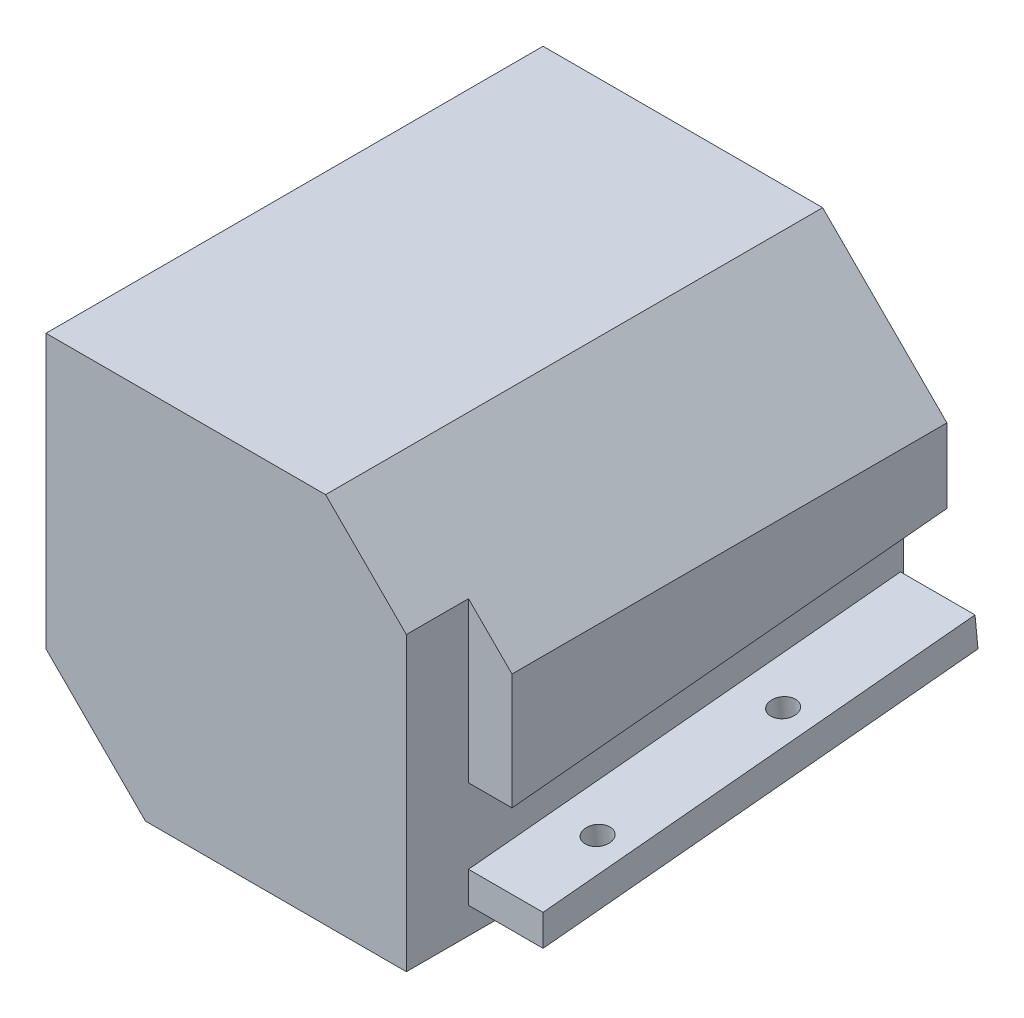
ISO-10303-21;
HEADER;
FILE_DESCRIPTION(('STEP AP214'),'2;1');
FILE_NAME('part.step','',(''),(''),'','','');
FILE_SCHEMA(('AUTOMOTIVE_DESIGN { 1 0 10303 214 1 1 1 1 }'));
ENDSEC;
DATA;
#1=APPLICATION_CONTEXT('core data for automotive mechanical design processes');
#2=APPLICATION_PROTOCOL_DEFINITION('international standard','automotive_design',2000,#1);
#3=PRODUCT_CONTEXT('',#1,'mechanical');
#4=PRODUCT('Part','Part','',(#3));
#5=PRODUCT_RELATED_PRODUCT_CATEGORY('part','',(#4));
#6=PRODUCT_DEFINITION_FORMATION('','',#4);
#7=PRODUCT_DEFINITION_CONTEXT('part definition',#1,'design');
#8=PRODUCT_DEFINITION('design','',#6,#7);
#9=PRODUCT_DEFINITION_SHAPE('','',#8);
#10=(LENGTH_UNIT() NAMED_UNIT(*) SI_UNIT(.MILLI.,.METRE.));
#11=(NAMED_UNIT(*) PLANE_ANGLE_UNIT() SI_UNIT($,.RADIAN.));
#12=(NAMED_UNIT(*) SI_UNIT($,.STERADIAN.) SOLID_ANGLE_UNIT());
#13=UNCERTAINTY_MEASURE_WITH_UNIT(LENGTH_MEASURE(1.E-05),#10,'distance_accuracy_value','');
#14=(GEOMETRIC_REPRESENTATION_CONTEXT(3) GLOBAL_UNCERTAINTY_ASSIGNED_CONTEXT((#13)) GLOBAL_UNIT_ASSIGNED_CONTEXT((#10,
#11,#12)) REPRESENTATION_CONTEXT('',''));
#15=CARTESIAN_POINT('',(0.,0.,0.));
#16=DIRECTION('',(0.,0.,1.));
#17=DIRECTION('',(1.,0.,0.));
#18=AXIS2_PLACEMENT_3D('',#15,#16,#17);
#19=CARTESIAN_POINT('',(30.,30.,50.));
#20=DIRECTION('',(0.,0.,1.));
#21=DIRECTION('',(1.,0.,0.));
#22=AXIS2_PLACEMENT_3D('',#19,#20,#21);
#23=PLANE('',#22);
#24=DIRECTION('',(1.,0.,0.));
#25=VECTOR('',#24,1.);
#26=CARTESIAN_POINT('',(7.99999999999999,9.99999999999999,50.));
#27=LINE('',#26,#25);
#28=CARTESIAN_POINT('',(32.,9.99999999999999,50.));
#29=VERTEX_POINT('',#28);
#30=CARTESIAN_POINT('',(28.,9.99999999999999,50.));
#31=VERTEX_POINT('',#30);
#32=EDGE_CURVE('E144',#29,#31,#27,.F.);
#33=ORIENTED_EDGE('',*,*,#32,.T.);
#34=CARTESIAN_POINT('',(28.,30.,50.));
#35=DIRECTION('',(0.,0.,1.));
#36=DIRECTION('',(1.,0.,0.));
#37=AXIS2_PLACEMENT_3D('',#34,#35,#36);
#38=CIRCLE('',#37,20.);
#39=CARTESIAN_POINT('',(28.,50.,50.));
#40=VERTEX_POINT('',#39);
#41=EDGE_CURVE('E163',#31,#40,#38,.F.);
#42=ORIENTED_EDGE('',*,*,#41,.T.);
#43=DIRECTION('',(-1.,0.,0.));
#44=VECTOR('',#43,1.);
#45=CARTESIAN_POINT('',(52.,50.,50.));
#46=LINE('',#45,#44);
#47=CARTESIAN_POINT('',(32.,50.,50.));
#48=VERTEX_POINT('',#47);
#49=EDGE_CURVE('E139',#40,#48,#46,.F.);
#50=ORIENTED_EDGE('',*,*,#49,.T.);
#51=CARTESIAN_POINT('',(32.,30.,50.));
#52=DIRECTION('',(0.,0.,1.));
#53=DIRECTION('',(1.,0.,0.));
#54=AXIS2_PLACEMENT_3D('',#51,#52,#53);
#55=CIRCLE('',#54,20.);
#56=EDGE_CURVE('E20',#48,#29,#55,.F.);
#57=ORIENTED_EDGE('',*,*,#56,.T.);
#58=EDGE_LOOP('',(#33,#42,#50,#57));
#59=FACE_BOUND('',#58,.T.);
#60=ADVANCED_FACE('F17',(#59),#23,.F.);
#61=CARTESIAN_POINT('',(65.,8.12112835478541,55.9818014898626));
#62=DIRECTION('',(0.,-0.995396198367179,-0.0958457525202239));
#63=DIRECTION('',(0.,0.0958457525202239,-0.995396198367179));
#64=AXIS2_PLACEMENT_3D('',#61,#62,#63);
#65=CYLINDRICAL_SURFACE('',#64,2.);
#66=CARTESIAN_POINT('',(65.,10.6096188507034,56.2214158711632));
#67=DIRECTION('',(0.,-0.995396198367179,-0.0958457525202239));
#68=DIRECTION('',(0.,0.0958457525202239,-0.995396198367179));
#69=AXIS2_PLACEMENT_3D('',#66,#67,#68);
#70=CIRCLE('',#69,2.);
#71=CARTESIAN_POINT('',(65.,10.8013103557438,54.2306234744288));
#72=VERTEX_POINT('',#71);
#73=EDGE_CURVE('E215',#72,#72,#70,.F.);
#74=ORIENTED_EDGE('',*,*,#73,.T.);
#75=EDGE_LOOP('',(#74));
#76=FACE_BOUND('',#75,.T.);
#77=CARTESIAN_POINT('',(65.,5.63263785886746,55.742187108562));
#78=DIRECTION('',(0.,-0.995396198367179,-0.0958457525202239));
#79=DIRECTION('',(0.,0.0958457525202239,-0.995396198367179));
#80=AXIS2_PLACEMENT_3D('',#77,#78,#79);
#81=CIRCLE('',#80,2.);
#82=CARTESIAN_POINT('',(65.,5.8243293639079,53.7513947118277));
#83=VERTEX_POINT('',#82);
#84=EDGE_CURVE('E223',#83,#83,#81,.T.);
#85=ORIENTED_EDGE('',*,*,#84,.T.);
#86=EDGE_LOOP('',(#85));
#87=FACE_BOUND('',#86,.T.);
#88=ADVANCED_FACE('F366',(#76,#87),#65,.F.);
#89=CARTESIAN_POINT('',(65.,10.9965009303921,26.1199155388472));
#90=DIRECTION('',(0.,-0.995396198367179,-0.0958457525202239));
#91=DIRECTION('',(0.,0.0958457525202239,-0.995396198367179));
#92=AXIS2_PLACEMENT_3D('',#89,#90,#91);
#93=CYLINDRICAL_SURFACE('',#92,2.);
#94=CARTESIAN_POINT('',(65.,13.4849914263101,26.3595299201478));
#95=DIRECTION('',(0.,-0.995396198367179,-0.0958457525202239));
#96=DIRECTION('',(0.,0.0958457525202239,-0.995396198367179));
#97=AXIS2_PLACEMENT_3D('',#94,#95,#96);
#98=CIRCLE('',#97,2.);
#99=CARTESIAN_POINT('',(65.,13.6766829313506,24.3687375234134));
#100=VERTEX_POINT('',#99);
#101=EDGE_CURVE('E211',#100,#100,#98,.F.);
#102=ORIENTED_EDGE('',*,*,#101,.T.);
#103=EDGE_LOOP('',(#102));
#104=FACE_BOUND('',#103,.T.);
#105=CARTESIAN_POINT('',(65.,8.50801043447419,25.8803011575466));
#106=DIRECTION('',(0.,-0.995396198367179,-0.0958457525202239));
#107=DIRECTION('',(0.,0.0958457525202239,-0.995396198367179));
#108=AXIS2_PLACEMENT_3D('',#105,#106,#107);
#109=CIRCLE('',#108,2.);
#110=CARTESIAN_POINT('',(65.,8.69970193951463,23.8895087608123));
#111=VERTEX_POINT('',#110);
#112=EDGE_CURVE('E219',#111,#111,#109,.T.);
#113=ORIENTED_EDGE('',*,*,#112,.T.);
#114=EDGE_LOOP('',(#113));
#115=FACE_BOUND('',#114,.T.);
#116=ADVANCED_FACE('F358',(#104,#115),#93,.F.);
#117=CARTESIAN_POINT('',(70.,0.,0.));
#118=DIRECTION('',(1.,0.,0.));
#119=DIRECTION('',(0.,0.,-1.));
#120=AXIS2_PLACEMENT_3D('',#117,#118,#119);
#121=PLANE('',#120);
#122=DIRECTION('',(0.,1.,0.));
#123=VECTOR('',#122,1.);
#124=CARTESIAN_POINT('',(70.,60.,70.));
#125=LINE('',#124,#123);
#126=CARTESIAN_POINT('',(70.,9.28289209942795,70.));
#127=VERTEX_POINT('',#126);
#128=CARTESIAN_POINT('',(70.,4.2597666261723,70.));
#129=VERTEX_POINT('',#128);
#130=EDGE_CURVE('E222',#127,#129,#125,.F.);
#131=ORIENTED_EDGE('',*,*,#130,.T.);
#132=DIRECTION('',(0.,-0.0958457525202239,0.995396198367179));
#133=VECTOR('',#132,1.);
#134=CARTESIAN_POINT('',(70.,4.2597666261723,70.));
#135=LINE('',#134,#133);
#136=CARTESIAN_POINT('',(70.,11.,0.));
#137=VERTEX_POINT('',#136);
#138=EDGE_CURVE('E225',#129,#137,#135,.F.);
#139=ORIENTED_EDGE('',*,*,#138,.T.);
#140=DIRECTION('',(0.,-0.995396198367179,-0.0958457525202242));
#141=VECTOR('',#140,1.);
#142=CARTESIAN_POINT('',(70.,11.,0.));
#143=LINE('',#142,#141);
#144=CARTESIAN_POINT('',(70.,15.9769809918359,0.479228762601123));
#145=VERTEX_POINT('',#144);
#146=EDGE_CURVE('E269',#137,#145,#143,.F.);
#147=ORIENTED_EDGE('',*,*,#146,.T.);
#148=DIRECTION('',(0.,0.095845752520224,-0.995396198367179));
#149=VECTOR('',#148,1.);
#150=CARTESIAN_POINT('',(70.,19.9696508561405,-40.9862331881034));
#151=LINE('',#150,#149);
#152=EDGE_CURVE('E275',#145,#127,#151,.F.);
#153=ORIENTED_EDGE('',*,*,#152,.T.);
#154=EDGE_LOOP('',(#131,#139,#147,#153));
#155=FACE_BOUND('',#154,.T.);
#156=ADVANCED_FACE('F355',(#155),#121,.T.);
#157=CARTESIAN_POINT('',(52.,50.,0.));
#158=DIRECTION('',(0.,1.,0.));
#159=DIRECTION('',(-1.,0.,0.));
#160=AXIS2_PLACEMENT_3D('',#157,#158,#159);
#161=PLANE('',#160);
#162=DIRECTION('',(0.,0.,1.));
#163=VECTOR('',#162,1.);
#164=CARTESIAN_POINT('',(32.,50.,0.));
#165=LINE('',#164,#163);
#166=CARTESIAN_POINT('',(32.,49.9999999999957,9.9999999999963));
#167=VERTEX_POINT('',#166);
#168=EDGE_CURVE('E149',#167,#48,#165,.T.);
#169=ORIENTED_EDGE('',*,*,#168,.T.);
#170=ORIENTED_EDGE('',*,*,#49,.F.);
#171=DIRECTION('',(0.,0.,1.));
#172=VECTOR('',#171,1.);
#173=CARTESIAN_POINT('',(28.,50.,0.));
#174=LINE('',#173,#172);
#175=CARTESIAN_POINT('',(28.,49.9999999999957,9.99999999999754));
#176=VERTEX_POINT('',#175);
#177=EDGE_CURVE('E226',#40,#176,#174,.F.);
#178=ORIENTED_EDGE('',*,*,#177,.T.);
#179=DIRECTION('',(1.,0.,0.));
#180=VECTOR('',#179,1.);
#181=CARTESIAN_POINT('',(43.5,50.,9.99999999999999));
#182=LINE('',#181,#180);
#183=EDGE_CURVE('E258',#167,#176,#182,.F.);
#184=ORIENTED_EDGE('',*,*,#183,.F.);
#185=EDGE_LOOP('',(#169,#170,#178,#184));
#186=FACE_BOUND('',#185,.T.);
#187=ADVANCED_FACE('F357',(#186),#161,.F.);
#188=CARTESIAN_POINT('',(32.,30.,0.));
#189=DIRECTION('',(0.,0.,1.));
#190=DIRECTION('',(1.,0.,0.));
#191=AXIS2_PLACEMENT_3D('',#188,#189,#190);
#192=CYLINDRICAL_SURFACE('',#191,20.);
#193=DIRECTION('',(0.,0.,1.));
#194=VECTOR('',#193,1.);
#195=CARTESIAN_POINT('',(32.,9.99999999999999,0.));
#196=LINE('',#195,#194);
#197=CARTESIAN_POINT('',(32.,10.0000000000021,9.99999999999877));
#198=VERTEX_POINT('',#197);
#199=EDGE_CURVE('E148',#198,#29,#196,.T.);
#200=ORIENTED_EDGE('',*,*,#199,.T.);
#201=ORIENTED_EDGE('',*,*,#56,.F.);
#202=ORIENTED_EDGE('',*,*,#168,.F.);
#203=CARTESIAN_POINT('',(32.,30.,9.99999999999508));
#204=DIRECTION('',(0.,0.,-1.));
#205=DIRECTION('',(0.707106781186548,-0.707106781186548,0.));
#206=AXIS2_PLACEMENT_3D('',#203,#204,#205);
#207=CIRCLE('',#206,19.9999999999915);
#208=EDGE_CURVE('E153',#167,#198,#207,.T.);
#209=ORIENTED_EDGE('',*,*,#208,.T.);
#210=EDGE_LOOP('',(#200,#201,#202,#209));
#211=FACE_BOUND('',#210,.T.);
#212=ADVANCED_FACE('F151',(#211),#192,.F.);
#213=CARTESIAN_POINT('',(7.99999999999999,9.99999999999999,0.));
#214=DIRECTION('',(0.,-1.,0.));
#215=DIRECTION('',(1.,0.,0.));
#216=AXIS2_PLACEMENT_3D('',#213,#214,#215);
#217=PLANE('',#216);
#218=DIRECTION('',(0.,0.,1.));
#219=VECTOR('',#218,1.);
#220=CARTESIAN_POINT('',(28.,10.,0.));
#221=LINE('',#220,#219);
#222=CARTESIAN_POINT('',(28.,10.0000000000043,9.99999999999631));
#223=VERTEX_POINT('',#222);
#224=EDGE_CURVE('E160',#223,#31,#221,.T.);
#225=ORIENTED_EDGE('',*,*,#224,.T.);
#226=ORIENTED_EDGE('',*,*,#32,.F.);
#227=ORIENTED_EDGE('',*,*,#199,.F.);
#228=DIRECTION('',(1.,0.,0.));
#229=VECTOR('',#228,1.);
#230=CARTESIAN_POINT('',(21.5,9.99999999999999,10.));
#231=LINE('',#230,#229);
#232=EDGE_CURVE('E240',#223,#198,#231,.T.);
#233=ORIENTED_EDGE('',*,*,#232,.F.);
#234=EDGE_LOOP('',(#225,#226,#227,#233));
#235=FACE_BOUND('',#234,.T.);
#236=ADVANCED_FACE('F158',(#235),#217,.F.);
#237=CARTESIAN_POINT('',(28.,30.,0.));
#238=DIRECTION('',(0.,0.,1.));
#239=DIRECTION('',(1.,0.,0.));
#240=AXIS2_PLACEMENT_3D('',#237,#238,#239);
#241=CYLINDRICAL_SURFACE('',#240,20.);
#242=ORIENTED_EDGE('',*,*,#177,.F.);
#243=ORIENTED_EDGE('',*,*,#41,.F.);
#244=ORIENTED_EDGE('',*,*,#224,.F.);
#245=CARTESIAN_POINT('',(28.,30.,9.99999999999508));
#246=DIRECTION('',(0.,0.,-1.));
#247=DIRECTION('',(-0.707106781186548,0.707106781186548,0.));
#248=AXIS2_PLACEMENT_3D('',#245,#246,#247);
#249=CIRCLE('',#248,19.9999999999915);
#250=EDGE_CURVE('E300',#223,#176,#249,.T.);
#251=ORIENTED_EDGE('',*,*,#250,.T.);
#252=EDGE_LOOP('',(#242,#243,#244,#251));
#253=FACE_BOUND('',#252,.T.);
#254=ADVANCED_FACE('F438',(#253),#241,.F.);
#255=CARTESIAN_POINT('',(70.,4.2597666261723,70.));
#256=DIRECTION('',(0.,0.995396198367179,0.0958457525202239));
#257=DIRECTION('',(0.,-0.0958457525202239,0.995396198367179));
#258=AXIS2_PLACEMENT_3D('',#255,#256,#257);
#259=PLANE('',#258);
#260=ORIENTED_EDGE('',*,*,#112,.F.);
#261=EDGE_LOOP('',(#260));
#262=FACE_BOUND('',#261,.T.);
#263=ORIENTED_EDGE('',*,*,#84,.F.);
#264=EDGE_LOOP('',(#263));
#265=FACE_BOUND('',#264,.T.);
#266=DIRECTION('',(1.,0.,0.));
#267=VECTOR('',#266,1.);
#268=CARTESIAN_POINT('',(70.,4.2597666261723,70.));
#269=LINE('',#268,#267);
#270=CARTESIAN_POINT('',(58.,4.2597666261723,70.));
#271=VERTEX_POINT('',#270);
#272=EDGE_CURVE('E277',#129,#271,#269,.F.);
#273=ORIENTED_EDGE('',*,*,#272,.T.);
#274=DIRECTION('',(0.,-0.0958457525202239,0.995396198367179));
#275=VECTOR('',#274,1.);
#276=CARTESIAN_POINT('',(58.,11.,0.));
#277=LINE('',#276,#275);
#278=CARTESIAN_POINT('',(58.,11.,0.));
#279=VERTEX_POINT('',#278);
#280=EDGE_CURVE('E199',#279,#271,#277,.T.);
#281=ORIENTED_EDGE('',*,*,#280,.F.);
#282=DIRECTION('',(1.,0.,0.));
#283=VECTOR('',#282,1.);
#284=CARTESIAN_POINT('',(70.,11.,0.));
#285=LINE('',#284,#283);
#286=EDGE_CURVE('E272',#279,#137,#285,.T.);
#287=ORIENTED_EDGE('',*,*,#286,.T.);
#288=ORIENTED_EDGE('',*,*,#138,.F.);
#289=EDGE_LOOP('',(#273,#281,#287,#288));
#290=FACE_BOUND('',#289,.T.);
#291=ADVANCED_FACE('F351',(#262,#265,#290),#259,.F.);
#292=CARTESIAN_POINT('',(70.,60.,70.));
#293=DIRECTION('',(0.,0.,-1.));
#294=DIRECTION('',(0.,1.,0.));
#295=AXIS2_PLACEMENT_3D('',#292,#293,#294);
#296=PLANE('',#295);
#297=ORIENTED_EDGE('',*,*,#130,.F.);
#298=DIRECTION('',(1.,0.,0.));
#299=VECTOR('',#298,1.);
#300=CARTESIAN_POINT('',(70.,9.28289209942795,70.));
#301=LINE('',#300,#299);
#302=CARTESIAN_POINT('',(58.,9.28289209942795,70.));
#303=VERTEX_POINT('',#302);
#304=EDGE_CURVE('E218',#127,#303,#301,.F.);
#305=ORIENTED_EDGE('',*,*,#304,.T.);
#306=DIRECTION('',(0.,1.,0.));
#307=VECTOR('',#306,1.);
#308=CARTESIAN_POINT('',(58.,3.89588081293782,70.));
#309=LINE('',#308,#307);
#310=EDGE_CURVE('E196',#271,#303,#309,.T.);
#311=ORIENTED_EDGE('',*,*,#310,.F.);
#312=ORIENTED_EDGE('',*,*,#272,.F.);
#313=EDGE_LOOP('',(#297,#305,#311,#312));
#314=FACE_BOUND('',#313,.T.);
#315=ADVANCED_FACE('F342',(#314),#296,.F.);
#316=CARTESIAN_POINT('',(70.,19.9696508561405,-40.9862331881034));
#317=DIRECTION('',(0.,-0.995396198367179,-0.095845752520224));
#318=DIRECTION('',(0.,0.095845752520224,-0.995396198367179));
#319=AXIS2_PLACEMENT_3D('',#316,#317,#318);
#320=PLANE('',#319);
#321=ORIENTED_EDGE('',*,*,#101,.F.);
#322=EDGE_LOOP('',(#321));
#323=FACE_BOUND('',#322,.T.);
#324=ORIENTED_EDGE('',*,*,#73,.F.);
#325=EDGE_LOOP('',(#324));
#326=FACE_BOUND('',#325,.T.);
#327=DIRECTION('',(0.,0.095845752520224,-0.995396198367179));
#328=VECTOR('',#327,1.);
#329=CARTESIAN_POINT('',(58.,9.28289209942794,70.));
#330=LINE('',#329,#328);
#331=CARTESIAN_POINT('',(58.,15.9769809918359,0.479228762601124));
#332=VERTEX_POINT('',#331);
#333=EDGE_CURVE('E193',#303,#332,#330,.T.);
#334=ORIENTED_EDGE('',*,*,#333,.F.);
#335=ORIENTED_EDGE('',*,*,#304,.F.);
#336=ORIENTED_EDGE('',*,*,#152,.F.);
#337=DIRECTION('',(1.,0.,0.));
#338=VECTOR('',#337,1.);
#339=CARTESIAN_POINT('',(70.,15.9769809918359,0.479228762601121));
#340=LINE('',#339,#338);
#341=EDGE_CURVE('E214',#145,#332,#340,.F.);
#342=ORIENTED_EDGE('',*,*,#341,.T.);
#343=EDGE_LOOP('',(#334,#335,#336,#342));
#344=FACE_BOUND('',#343,.T.);
#345=ADVANCED_FACE('F344',(#323,#326,#344),#320,.F.);
#346=CARTESIAN_POINT('',(70.,11.,0.));
#347=DIRECTION('',(0.,-0.0958457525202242,0.995396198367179));
#348=DIRECTION('',(0.,-0.995396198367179,-0.0958457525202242));
#349=AXIS2_PLACEMENT_3D('',#346,#347,#348);
#350=PLANE('',#349);
#351=ORIENTED_EDGE('',*,*,#286,.F.);
#352=DIRECTION('',(0.,-0.995396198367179,-0.0958457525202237));
#353=VECTOR('',#352,1.);
#354=CARTESIAN_POINT('',(58.,15.9769809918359,0.479228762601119));
#355=LINE('',#354,#353);
#356=EDGE_CURVE('E190',#332,#279,#355,.T.);
#357=ORIENTED_EDGE('',*,*,#356,.F.);
#358=ORIENTED_EDGE('',*,*,#341,.F.);
#359=ORIENTED_EDGE('',*,*,#146,.F.);
#360=EDGE_LOOP('',(#351,#357,#358,#359));
#361=FACE_BOUND('',#360,.T.);
#362=ADVANCED_FACE('F354',(#361),#350,.F.);
#363=CARTESIAN_POINT('',(70.,60.,70.));
#364=DIRECTION('',(0.,0.,-1.));
#365=DIRECTION('',(0.,1.,0.));
#366=AXIS2_PLACEMENT_3D('',#363,#364,#365);
#367=PLANE('',#366);
#368=DIRECTION('',(0.,1.,0.));
#369=VECTOR('',#368,1.);
#370=CARTESIAN_POINT('',(58.,3.89588081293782,70.));
#371=LINE('',#370,#369);
#372=CARTESIAN_POINT('',(58.,21.3383932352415,70.));
#373=VERTEX_POINT('',#372);
#374=CARTESIAN_POINT('',(58.,47.,70.));
#375=VERTEX_POINT('',#374);
#376=EDGE_CURVE('E202',#373,#375,#371,.T.);
#377=ORIENTED_EDGE('',*,*,#376,.F.);
#378=DIRECTION('',(1.,0.,0.));
#379=VECTOR('',#378,1.);
#380=CARTESIAN_POINT('',(70.,21.3383932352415,70.));
#381=LINE('',#380,#379);
#382=CARTESIAN_POINT('',(65.,21.3383932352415,70.));
#383=VERTEX_POINT('',#382);
#384=EDGE_CURVE('E264',#373,#383,#381,.T.);
#385=ORIENTED_EDGE('',*,*,#384,.T.);
#386=DIRECTION('',(0.,1.,0.));
#387=VECTOR('',#386,1.);
#388=CARTESIAN_POINT('',(65.,42.2733158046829,70.));
#389=LINE('',#388,#387);
#390=CARTESIAN_POINT('',(65.,40.,70.));
#391=VERTEX_POINT('',#390);
#392=EDGE_CURVE('E259',#391,#383,#389,.F.);
#393=ORIENTED_EDGE('',*,*,#392,.F.);
#394=DIRECTION('',(-0.707106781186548,0.707106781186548,0.));
#395=VECTOR('',#394,1.);
#396=CARTESIAN_POINT('',(55.,50.,70.));
#397=LINE('',#396,#395);
#398=EDGE_CURVE('E189',#375,#391,#397,.F.);
#399=ORIENTED_EDGE('',*,*,#398,.F.);
#400=EDGE_LOOP('',(#377,#385,#393,#399));
#401=FACE_BOUND('',#400,.T.);
#402=ADVANCED_FACE('F424',(#401),#367,.F.);
#403=CARTESIAN_POINT('',(70.,18.6824455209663,97.5830716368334));
#404=DIRECTION('',(0.,0.995396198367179,0.0958457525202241));
#405=DIRECTION('',(0.,-0.0958457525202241,0.995396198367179));
#406=AXIS2_PLACEMENT_3D('',#403,#404,#405);
#407=PLANE('',#406);
#408=ORIENTED_EDGE('',*,*,#384,.F.);
#409=DIRECTION('',(0.,-0.095845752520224,0.995396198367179));
#410=VECTOR('',#409,1.);
#411=CARTESIAN_POINT('',(58.,28.0786266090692,0.));
#412=LINE('',#411,#410);
#413=CARTESIAN_POINT('',(58.,28.0786266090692,0.));
#414=VERTEX_POINT('',#413);
#415=EDGE_CURVE('E204',#414,#373,#412,.T.);
#416=ORIENTED_EDGE('',*,*,#415,.F.);
#417=DIRECTION('',(1.,0.,0.));
#418=VECTOR('',#417,1.);
#419=CARTESIAN_POINT('',(35.,28.0786266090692,0.));
#420=LINE('',#419,#418);
#421=CARTESIAN_POINT('',(65.,28.0786266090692,0.));
#422=VERTEX_POINT('',#421);
#423=EDGE_CURVE('E184',#414,#422,#420,.T.);
#424=ORIENTED_EDGE('',*,*,#423,.T.);
#425=DIRECTION('',(0.,0.0958457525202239,-0.995396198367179));
#426=VECTOR('',#425,1.);
#427=CARTESIAN_POINT('',(65.,21.3383932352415,70.));
#428=LINE('',#427,#426);
#429=EDGE_CURVE('E255',#383,#422,#428,.T.);
#430=ORIENTED_EDGE('',*,*,#429,.F.);
#431=EDGE_LOOP('',(#408,#416,#424,#430));
#432=FACE_BOUND('',#431,.T.);
#433=ADVANCED_FACE('F420',(#432),#407,.F.);
#434=CARTESIAN_POINT('',(65.,42.2733158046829,36.1185425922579));
#435=DIRECTION('',(1.,0.,0.));
#436=DIRECTION('',(0.,0.,-1.));
#437=AXIS2_PLACEMENT_3D('',#434,#435,#436);
#438=PLANE('',#437);
#439=ORIENTED_EDGE('',*,*,#429,.T.);
#440=DIRECTION('',(0.,1.,0.));
#441=VECTOR('',#440,1.);
#442=CARTESIAN_POINT('',(65.,30.,0.));
#443=LINE('',#442,#441);
#444=CARTESIAN_POINT('',(65.,40.,0.));
#445=VERTEX_POINT('',#444);
#446=EDGE_CURVE('E324',#422,#445,#443,.T.);
#447=ORIENTED_EDGE('',*,*,#446,.T.);
#448=DIRECTION('',(0.,0.,1.));
#449=VECTOR('',#448,1.);
#450=CARTESIAN_POINT('',(65.,40.,18.0592712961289));
#451=LINE('',#450,#449);
#452=EDGE_CURVE('E332',#391,#445,#451,.F.);
#453=ORIENTED_EDGE('',*,*,#452,.F.);
#454=ORIENTED_EDGE('',*,*,#392,.T.);
#455=EDGE_LOOP('',(#439,#447,#453,#454));
#456=FACE_BOUND('',#455,.T.);
#457=ADVANCED_FACE('F416',(#456),#438,.T.);
#458=CARTESIAN_POINT('',(43.5,52.8867513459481,5.));
#459=DIRECTION('',(0.,-0.866025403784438,-0.5));
#460=DIRECTION('',(0.,0.5,-0.866025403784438));
#461=AXIS2_PLACEMENT_3D('',#458,#459,#460);
#462=PLANE('',#461);
#463=DIRECTION('',(0.,-0.500000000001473,0.866025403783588));
#464=VECTOR('',#463,1.);
#465=CARTESIAN_POINT('',(32.,52.8867513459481,5.));
#466=LINE('',#465,#464);
#467=CARTESIAN_POINT('',(32.,55.7735026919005,4.8919202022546E-12));
#468=VERTEX_POINT('',#467);
#469=EDGE_CURVE('E249',#468,#167,#466,.T.);
#470=ORIENTED_EDGE('',*,*,#469,.T.);
#471=ORIENTED_EDGE('',*,*,#183,.T.);
#472=DIRECTION('',(0.,-0.500000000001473,0.866025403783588));
#473=VECTOR('',#472,1.);
#474=CARTESIAN_POINT('',(28.,52.8867513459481,5.));
#475=LINE('',#474,#473);
#476=CARTESIAN_POINT('',(28.,55.7735026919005,4.88498130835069E-12));
#477=VERTEX_POINT('',#476);
#478=EDGE_CURVE('E301',#176,#477,#475,.F.);
#479=ORIENTED_EDGE('',*,*,#478,.T.);
#480=DIRECTION('',(1.,0.,0.));
#481=VECTOR('',#480,1.);
#482=CARTESIAN_POINT('',(35.,55.7735026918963,0.));
#483=LINE('',#482,#481);
#484=EDGE_CURVE('E180',#477,#468,#483,.T.);
#485=ORIENTED_EDGE('',*,*,#484,.T.);
#486=EDGE_LOOP('',(#470,#471,#479,#485));
#487=FACE_BOUND('',#486,.T.);
#488=ADVANCED_FACE('F412',(#487),#462,.T.);
#489=CARTESIAN_POINT('',(32.,30.,4.89365492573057E-12));
#490=DIRECTION('',(0.,0.,-1.));
#491=DIRECTION('',(-1.,0.,0.));
#492=AXIS2_PLACEMENT_3D('',#489,#490,#491);
#493=CONICAL_SURFACE('',#492,25.7735026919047,0.5235987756);
#494=ORIENTED_EDGE('',*,*,#208,.F.);
#495=ORIENTED_EDGE('',*,*,#469,.F.);
#496=CARTESIAN_POINT('',(32.,30.,4.8919202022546E-12));
#497=DIRECTION('',(0.,0.,-1.));
#498=DIRECTION('',(-1.,0.,0.));
#499=AXIS2_PLACEMENT_3D('',#496,#497,#498);
#500=CIRCLE('',#499,25.7735026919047);
#501=CARTESIAN_POINT('',(32.,4.22649730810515,2.44530957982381E-12));
#502=VERTEX_POINT('',#501);
#503=EDGE_CURVE('E178',#468,#502,#500,.T.);
#504=ORIENTED_EDGE('',*,*,#503,.T.);
#505=DIRECTION('',(0.,0.5,0.866025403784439));
#506=VECTOR('',#505,1.);
#507=CARTESIAN_POINT('',(32.,7.11324865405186,5.));
#508=LINE('',#507,#506);
#509=EDGE_CURVE('E243',#198,#502,#508,.F.);
#510=ORIENTED_EDGE('',*,*,#509,.F.);
#511=EDGE_LOOP('',(#494,#495,#504,#510));
#512=FACE_BOUND('',#511,.T.);
#513=ADVANCED_FACE('F409',(#512),#493,.F.);
#514=CARTESIAN_POINT('',(21.5,7.11324865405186,5.));
#515=DIRECTION('',(0.,0.866025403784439,-0.5));
#516=DIRECTION('',(0.,0.5,0.866025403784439));
#517=AXIS2_PLACEMENT_3D('',#514,#515,#516);
#518=PLANE('',#517);
#519=DIRECTION('',(0.,0.500000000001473,0.866025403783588));
#520=VECTOR('',#519,1.);
#521=CARTESIAN_POINT('',(28.,7.11324865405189,5.));
#522=LINE('',#521,#520);
#523=CARTESIAN_POINT('',(28.,4.22649730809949,4.88498130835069E-12));
#524=VERTEX_POINT('',#523);
#525=EDGE_CURVE('E242',#524,#223,#522,.T.);
#526=ORIENTED_EDGE('',*,*,#525,.T.);
#527=ORIENTED_EDGE('',*,*,#232,.T.);
#528=ORIENTED_EDGE('',*,*,#509,.T.);
#529=DIRECTION('',(1.,0.,0.));
#530=VECTOR('',#529,1.);
#531=CARTESIAN_POINT('',(35.,4.22649730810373,0.));
#532=LINE('',#531,#530);
#533=EDGE_CURVE('E177',#502,#524,#532,.F.);
#534=ORIENTED_EDGE('',*,*,#533,.T.);
#535=EDGE_LOOP('',(#526,#527,#528,#534));
#536=FACE_BOUND('',#535,.T.);
#537=ADVANCED_FACE('F405',(#536),#518,.T.);
#538=CARTESIAN_POINT('',(28.,30.,4.88324658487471E-12));
#539=DIRECTION('',(0.,0.,-1.));
#540=DIRECTION('',(-1.,0.,0.));
#541=AXIS2_PLACEMENT_3D('',#538,#539,#540);
#542=CONICAL_SURFACE('',#541,25.7735026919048,0.5235987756);
#543=ORIENTED_EDGE('',*,*,#250,.F.);
#544=ORIENTED_EDGE('',*,*,#525,.F.);
#545=CARTESIAN_POINT('',(28.,30.,4.88498130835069E-12));
#546=DIRECTION('',(0.,0.,-1.));
#547=DIRECTION('',(-1.,0.,0.));
#548=AXIS2_PLACEMENT_3D('',#545,#546,#547);
#549=CIRCLE('',#548,25.7735026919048);
#550=EDGE_CURVE('E173',#524,#477,#549,.T.);
#551=ORIENTED_EDGE('',*,*,#550,.T.);
#552=ORIENTED_EDGE('',*,*,#478,.F.);
#553=EDGE_LOOP('',(#543,#544,#551,#552));
#554=FACE_BOUND('',#553,.T.);
#555=ADVANCED_FACE('F401',(#554),#542,.F.);
#556=CARTESIAN_POINT('',(8.,8.,0.));
#557=DIRECTION('',(-0.707106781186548,-0.707106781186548,0.));
#558=DIRECTION('',(0.707106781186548,-0.707106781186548,0.));
#559=AXIS2_PLACEMENT_3D('',#556,#557,#558);
#560=PLANE('',#559);
#561=DIRECTION('',(0.707106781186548,-0.707106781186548,0.));
#562=VECTOR('',#561,1.);
#563=CARTESIAN_POINT('',(0.,16.,0.));
#564=LINE('',#563,#562);
#565=CARTESIAN_POINT('',(0.,16.,0.));
#566=VERTEX_POINT('',#565);
#567=CARTESIAN_POINT('',(16.,0.,0.));
#568=VERTEX_POINT('',#567);
#569=EDGE_CURVE('E327',#566,#568,#564,.T.);
#570=ORIENTED_EDGE('',*,*,#569,.T.);
#571=DIRECTION('',(0.,0.,-1.));
#572=VECTOR('',#571,1.);
#573=CARTESIAN_POINT('',(16.,0.,0.));
#574=LINE('',#573,#572);
#575=CARTESIAN_POINT('',(16.,0.,80.));
#576=VERTEX_POINT('',#575);
#577=EDGE_CURVE('E210',#576,#568,#574,.T.);
#578=ORIENTED_EDGE('',*,*,#577,.F.);
#579=DIRECTION('',(0.707106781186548,-0.707106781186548,0.));
#580=VECTOR('',#579,1.);
#581=CARTESIAN_POINT('',(0.,16.,80.));
#582=LINE('',#581,#580);
#583=CARTESIAN_POINT('',(0.,16.,80.));
#584=VERTEX_POINT('',#583);
#585=EDGE_CURVE('E639',#584,#576,#582,.T.);
#586=ORIENTED_EDGE('',*,*,#585,.F.);
#587=DIRECTION('',(0.,0.,1.));
#588=VECTOR('',#587,1.);
#589=CARTESIAN_POINT('',(0.,16.,0.));
#590=LINE('',#589,#588);
#591=EDGE_CURVE('E176',#566,#584,#590,.T.);
#592=ORIENTED_EDGE('',*,*,#591,.F.);
#593=EDGE_LOOP('',(#570,#578,#586,#592));
#594=FACE_BOUND('',#593,.T.);
#595=ADVANCED_FACE('F397',(#594),#560,.T.);
#596=CARTESIAN_POINT('',(0.,0.,0.));
#597=DIRECTION('',(0.,-1.,0.));
#598=DIRECTION('',(0.,0.,-1.));
#599=AXIS2_PLACEMENT_3D('',#596,#597,#598);
#600=PLANE('',#599);
#601=ORIENTED_EDGE('',*,*,#577,.T.);
#602=DIRECTION('',(1.,0.,0.));
#603=VECTOR('',#602,1.);
#604=CARTESIAN_POINT('',(35.,0.,0.));
#605=LINE('',#604,#603);
#606=CARTESIAN_POINT('',(58.,0.,0.));
#607=VERTEX_POINT('',#606);
#608=EDGE_CURVE('E185',#568,#607,#605,.T.);
#609=ORIENTED_EDGE('',*,*,#608,.T.);
#610=DIRECTION('',(0.,0.,-1.));
#611=VECTOR('',#610,1.);
#612=CARTESIAN_POINT('',(58.,0.,33.4837201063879));
#613=LINE('',#612,#611);
#614=CARTESIAN_POINT('',(58.,0.,80.));
#615=VERTEX_POINT('',#614);
#616=EDGE_CURVE('E207',#615,#607,#613,.T.);
#617=ORIENTED_EDGE('',*,*,#616,.F.);
#618=DIRECTION('',(1.,0.,0.));
#619=VECTOR('',#618,1.);
#620=CARTESIAN_POINT('',(35.,0.,80.));
#621=LINE('',#620,#619);
#622=EDGE_CURVE('E172',#576,#615,#621,.T.);
#623=ORIENTED_EDGE('',*,*,#622,.F.);
#624=EDGE_LOOP('',(#601,#609,#617,#623));
#625=FACE_BOUND('',#624,.T.);
#626=ADVANCED_FACE('F394',(#625),#600,.T.);
#627=CARTESIAN_POINT('',(58.,3.89588081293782,33.4837201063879));
#628=DIRECTION('',(1.,0.,0.));
#629=DIRECTION('',(0.,0.,-1.));
#630=AXIS2_PLACEMENT_3D('',#627,#628,#629);
#631=PLANE('',#630);
#632=ORIENTED_EDGE('',*,*,#333,.T.);
#633=ORIENTED_EDGE('',*,*,#356,.T.);
#634=ORIENTED_EDGE('',*,*,#280,.T.);
#635=ORIENTED_EDGE('',*,*,#310,.T.);
#636=EDGE_LOOP('',(#632,#633,#634,#635));
#637=FACE_BOUND('',#636,.T.);
#638=ORIENTED_EDGE('',*,*,#415,.T.);
#639=ORIENTED_EDGE('',*,*,#376,.T.);
#640=DIRECTION('',(0.,0.,1.));
#641=VECTOR('',#640,1.);
#642=CARTESIAN_POINT('',(58.,47.,18.0592712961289));
#643=LINE('',#642,#641);
#644=CARTESIAN_POINT('',(58.,47.,80.));
#645=VERTEX_POINT('',#644);
#646=EDGE_CURVE('E186',#645,#375,#643,.F.);
#647=ORIENTED_EDGE('',*,*,#646,.F.);
#648=DIRECTION('',(0.,1.,0.));
#649=VECTOR('',#648,1.);
#650=CARTESIAN_POINT('',(58.,30.,80.));
#651=LINE('',#650,#649);
#652=EDGE_CURVE('E168',#615,#645,#651,.T.);
#653=ORIENTED_EDGE('',*,*,#652,.F.);
#654=ORIENTED_EDGE('',*,*,#616,.T.);
#655=DIRECTION('',(0.,1.,0.));
#656=VECTOR('',#655,1.);
#657=CARTESIAN_POINT('',(58.,3.89588081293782,0.));
#658=LINE('',#657,#656);
#659=EDGE_CURVE('E181',#607,#414,#658,.T.);
#660=ORIENTED_EDGE('',*,*,#659,.T.);
#661=EDGE_LOOP('',(#638,#639,#647,#653,#654,#660));
#662=FACE_BOUND('',#661,.T.);
#663=ADVANCED_FACE('F348',(#637,#662),#631,.T.);
#664=CARTESIAN_POINT('',(55.,50.,18.0592712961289));
#665=DIRECTION('',(0.707106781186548,0.707106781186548,0.));
#666=DIRECTION('',(-0.707106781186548,0.707106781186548,0.));
#667=AXIS2_PLACEMENT_3D('',#664,#665,#666);
#668=PLANE('',#667);
#669=ORIENTED_EDGE('',*,*,#398,.T.);
#670=ORIENTED_EDGE('',*,*,#452,.T.);
#671=DIRECTION('',(-0.707106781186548,0.707106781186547,0.));
#672=VECTOR('',#671,1.);
#673=CARTESIAN_POINT('',(65.,40.,0.));
#674=LINE('',#673,#672);
#675=CARTESIAN_POINT('',(45.,60.,0.));
#676=VERTEX_POINT('',#675);
#677=EDGE_CURVE('E630',#445,#676,#674,.T.);
#678=ORIENTED_EDGE('',*,*,#677,.T.);
#679=DIRECTION('',(0.,0.,1.));
#680=VECTOR('',#679,1.);
#681=CARTESIAN_POINT('',(45.,60.,0.));
#682=LINE('',#681,#680);
#683=CARTESIAN_POINT('',(45.,60.,80.));
#684=VERTEX_POINT('',#683);
#685=EDGE_CURVE('E171',#684,#676,#682,.F.);
#686=ORIENTED_EDGE('',*,*,#685,.F.);
#687=DIRECTION('',(-0.707106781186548,0.707106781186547,0.));
#688=VECTOR('',#687,1.);
#689=CARTESIAN_POINT('',(58.,47.,80.));
#690=LINE('',#689,#688);
#691=EDGE_CURVE('E642',#645,#684,#690,.T.);
#692=ORIENTED_EDGE('',*,*,#691,.F.);
#693=ORIENTED_EDGE('',*,*,#646,.T.);
#694=EDGE_LOOP('',(#669,#670,#678,#686,#692,#693));
#695=FACE_BOUND('',#694,.T.);
#696=ADVANCED_FACE('F387',(#695),#668,.T.);
#697=CARTESIAN_POINT('',(35.,30.,0.));
#698=DIRECTION('',(0.,0.,1.));
#699=DIRECTION('',(1.,0.,0.));
#700=AXIS2_PLACEMENT_3D('',#697,#698,#699);
#701=PLANE('',#700);
#702=ORIENTED_EDGE('',*,*,#533,.F.);
#703=ORIENTED_EDGE('',*,*,#503,.F.);
#704=ORIENTED_EDGE('',*,*,#484,.F.);
#705=ORIENTED_EDGE('',*,*,#550,.F.);
#706=EDGE_LOOP('',(#702,#703,#704,#705));
#707=FACE_BOUND('',#706,.T.);
#708=ORIENTED_EDGE('',*,*,#446,.F.);
#709=ORIENTED_EDGE('',*,*,#423,.F.);
#710=ORIENTED_EDGE('',*,*,#659,.F.);
#711=ORIENTED_EDGE('',*,*,#608,.F.);
#712=ORIENTED_EDGE('',*,*,#569,.F.);
#713=DIRECTION('',(0.,1.,0.));
#714=VECTOR('',#713,1.);
#715=CARTESIAN_POINT('',(0.,60.,0.));
#716=LINE('',#715,#714);
#717=CARTESIAN_POINT('',(0.,60.,0.));
#718=VERTEX_POINT('',#717);
#719=EDGE_CURVE('E645',#718,#566,#716,.F.);
#720=ORIENTED_EDGE('',*,*,#719,.F.);
#721=DIRECTION('',(1.,0.,0.));
#722=VECTOR('',#721,1.);
#723=CARTESIAN_POINT('',(70.,60.,0.));
#724=LINE('',#723,#722);
#725=EDGE_CURVE('E628',#676,#718,#724,.F.);
#726=ORIENTED_EDGE('',*,*,#725,.F.);
#727=ORIENTED_EDGE('',*,*,#677,.F.);
#728=EDGE_LOOP('',(#708,#709,#710,#711,#712,#720,#726,#727));
#729=FACE_BOUND('',#728,.T.);
#730=ADVANCED_FACE('F384',(#707,#729),#701,.F.);
#731=CARTESIAN_POINT('',(0.,60.,0.));
#732=DIRECTION('',(-1.,0.,0.));
#733=DIRECTION('',(0.,0.,1.));
#734=AXIS2_PLACEMENT_3D('',#731,#732,#733);
#735=PLANE('',#734);
#736=DIRECTION('',(0.,0.,1.));
#737=VECTOR('',#736,1.);
#738=CARTESIAN_POINT('',(0.,60.,0.));
#739=LINE('',#738,#737);
#740=CARTESIAN_POINT('',(0.,60.,80.));
#741=VERTEX_POINT('',#740);
#742=EDGE_CURVE('E26',#718,#741,#739,.T.);
#743=ORIENTED_EDGE('',*,*,#742,.F.);
#744=ORIENTED_EDGE('',*,*,#719,.T.);
#745=ORIENTED_EDGE('',*,*,#591,.T.);
#746=DIRECTION('',(0.,1.,0.));
#747=VECTOR('',#746,1.);
#748=CARTESIAN_POINT('',(0.,30.,80.));
#749=LINE('',#748,#747);
#750=EDGE_CURVE('E35',#741,#584,#749,.F.);
#751=ORIENTED_EDGE('',*,*,#750,.F.);
#752=EDGE_LOOP('',(#743,#744,#745,#751));
#753=FACE_BOUND('',#752,.T.);
#754=ADVANCED_FACE('F377',(#753),#735,.T.);
#755=CARTESIAN_POINT('',(35.,30.,80.));
#756=DIRECTION('',(0.,0.,1.));
#757=DIRECTION('',(1.,0.,0.));
#758=AXIS2_PLACEMENT_3D('',#755,#756,#757);
#759=PLANE('',#758);
#760=ORIENTED_EDGE('',*,*,#622,.T.);
#761=ORIENTED_EDGE('',*,*,#652,.T.);
#762=ORIENTED_EDGE('',*,*,#691,.T.);
#763=DIRECTION('',(1.,0.,0.));
#764=VECTOR('',#763,1.);
#765=CARTESIAN_POINT('',(70.,60.,80.));
#766=LINE('',#765,#764);
#767=EDGE_CURVE('E11',#741,#684,#766,.T.);
#768=ORIENTED_EDGE('',*,*,#767,.F.);
#769=ORIENTED_EDGE('',*,*,#750,.T.);
#770=ORIENTED_EDGE('',*,*,#585,.T.);
#771=EDGE_LOOP('',(#760,#761,#762,#768,#769,#770));
#772=FACE_BOUND('',#771,.T.);
#773=ADVANCED_FACE('F371',(#772),#759,.T.);
#774=CARTESIAN_POINT('',(70.,60.,0.));
#775=DIRECTION('',(0.,1.,0.));
#776=DIRECTION('',(0.,0.,1.));
#777=AXIS2_PLACEMENT_3D('',#774,#775,#776);
#778=PLANE('',#777);
#779=ORIENTED_EDGE('',*,*,#742,.T.);
#780=ORIENTED_EDGE('',*,*,#767,.T.);
#781=ORIENTED_EDGE('',*,*,#685,.T.);
#782=ORIENTED_EDGE('',*,*,#725,.T.);
#783=EDGE_LOOP('',(#779,#780,#781,#782));
#784=FACE_BOUND('',#783,.T.);
#785=ADVANCED_FACE('F369',(#784),#778,.T.);
#786=CLOSED_SHELL('',(#60,#88,#116,#156,#187,#212,#236,#254,#291,#315,#345,#362,#402,#433,#457,
#488,#513,#537,#555,#595,#626,#663,#696,#730,#754,#773,#785));
#787=MANIFOLD_SOLID_BREP('B1',#786);
#788=ADVANCED_BREP_SHAPE_REPRESENTATION('',(#18,#787),#14);
#789=SHAPE_DEFINITION_REPRESENTATION(#9,#788);
ENDSEC;
END-ISO-10303-21;
